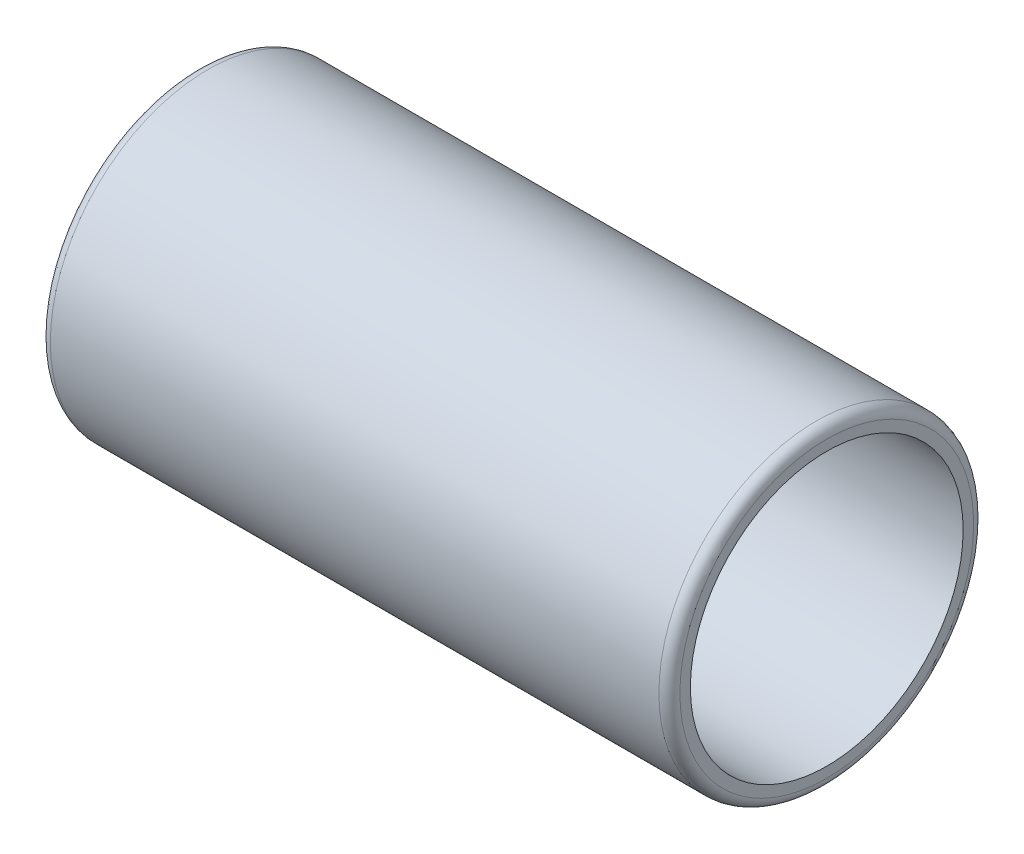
ISO-10303-21;
HEADER;
FILE_DESCRIPTION(('STEP AP214'),'2;1');
FILE_NAME('part.step','',(''),(''),'','','');
FILE_SCHEMA(('AUTOMOTIVE_DESIGN { 1 0 10303 214 1 1 1 1 }'));
ENDSEC;
DATA;
#1=APPLICATION_CONTEXT('core data for automotive mechanical design processes');
#2=APPLICATION_PROTOCOL_DEFINITION('international standard','automotive_design',2000,#1);
#3=PRODUCT_CONTEXT('',#1,'mechanical');
#4=PRODUCT('Part','Part','',(#3));
#5=PRODUCT_RELATED_PRODUCT_CATEGORY('part','',(#4));
#6=PRODUCT_DEFINITION_FORMATION('','',#4);
#7=PRODUCT_DEFINITION_CONTEXT('part definition',#1,'design');
#8=PRODUCT_DEFINITION('design','',#6,#7);
#9=PRODUCT_DEFINITION_SHAPE('','',#8);
#10=(LENGTH_UNIT() NAMED_UNIT(*) SI_UNIT(.MILLI.,.METRE.));
#11=(NAMED_UNIT(*) PLANE_ANGLE_UNIT() SI_UNIT($,.RADIAN.));
#12=(NAMED_UNIT(*) SI_UNIT($,.STERADIAN.) SOLID_ANGLE_UNIT());
#13=UNCERTAINTY_MEASURE_WITH_UNIT(LENGTH_MEASURE(1.E-05),#10,'distance_accuracy_value','');
#14=(GEOMETRIC_REPRESENTATION_CONTEXT(3) GLOBAL_UNCERTAINTY_ASSIGNED_CONTEXT((#13)) GLOBAL_UNIT_ASSIGNED_CONTEXT((#10,
#11,#12)) REPRESENTATION_CONTEXT('',''));
#15=CARTESIAN_POINT('',(0.,0.,0.));
#16=DIRECTION('',(0.,0.,1.));
#17=DIRECTION('',(1.,0.,0.));
#18=AXIS2_PLACEMENT_3D('',#15,#16,#17);
#19=CARTESIAN_POINT('',(0.,0.,0.));
#20=DIRECTION('',(-1.,0.,0.));
#21=DIRECTION('',(0.,0.,1.));
#22=AXIS2_PLACEMENT_3D('',#19,#20,#21);
#23=CYLINDRICAL_SURFACE('',#22,6.);
#24=CARTESIAN_POINT('',(5.99999999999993,0.,0.));
#25=DIRECTION('',(-1.,0.,0.));
#26=DIRECTION('',(0.,0.,1.));
#27=AXIS2_PLACEMENT_3D('',#24,#25,#26);
#28=CIRCLE('',#27,6.);
#29=CARTESIAN_POINT('',(5.99999999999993,0.,6.));
#30=VERTEX_POINT('',#29);
#31=EDGE_CURVE('E43',#30,#30,#28,.T.);
#32=ORIENTED_EDGE('',*,*,#31,.F.);
#33=EDGE_LOOP('',(#32));
#34=FACE_BOUND('',#33,.T.);
#35=CARTESIAN_POINT('',(0.,0.,0.));
#36=DIRECTION('',(-1.,0.,0.));
#37=DIRECTION('',(0.,0.,1.));
#38=AXIS2_PLACEMENT_3D('',#35,#36,#37);
#39=CIRCLE('',#38,6.);
#40=CARTESIAN_POINT('',(0.,0.,6.));
#41=VERTEX_POINT('',#40);
#42=EDGE_CURVE('E34',#41,#41,#39,.T.);
#43=ORIENTED_EDGE('',*,*,#42,.T.);
#44=EDGE_LOOP('',(#43));
#45=FACE_BOUND('',#44,.T.);
#46=ADVANCED_FACE('F14',(#34,#45),#23,.F.);
#47=CARTESIAN_POINT('',(0.,6.,0.));
#48=DIRECTION('',(1.,0.,0.));
#49=DIRECTION('',(0.,0.,-1.));
#50=AXIS2_PLACEMENT_3D('',#47,#48,#49);
#51=PLANE('',#50);
#52=CARTESIAN_POINT('',(0.,0.,0.));
#53=DIRECTION('',(1.,0.,0.));
#54=DIRECTION('',(0.,0.,-1.));
#55=AXIS2_PLACEMENT_3D('',#52,#53,#54);
#56=CIRCLE('',#55,14.);
#57=CARTESIAN_POINT('',(0.,0.,-14.));
#58=VERTEX_POINT('',#57);
#59=EDGE_CURVE('E21',#58,#58,#56,.F.);
#60=ORIENTED_EDGE('',*,*,#59,.T.);
#61=EDGE_LOOP('',(#60));
#62=FACE_BOUND('',#61,.T.);
#63=ORIENTED_EDGE('',*,*,#42,.F.);
#64=EDGE_LOOP('',(#63));
#65=FACE_BOUND('',#64,.T.);
#66=ADVANCED_FACE('F51',(#62,#65),#51,.F.);
#67=CARTESIAN_POINT('',(0.,0.,0.));
#68=DIRECTION('',(-1.,0.,0.));
#69=DIRECTION('',(0.,0.,1.));
#70=AXIS2_PLACEMENT_3D('',#67,#68,#69);
#71=CYLINDRICAL_SURFACE('',#70,15.);
#72=CARTESIAN_POINT('',(1.,0.,0.));
#73=DIRECTION('',(1.,0.,0.));
#74=DIRECTION('',(0.,0.,-1.));
#75=AXIS2_PLACEMENT_3D('',#72,#73,#74);
#76=CIRCLE('',#75,15.);
#77=CARTESIAN_POINT('',(1.,0.,-15.));
#78=VERTEX_POINT('',#77);
#79=EDGE_CURVE('E9',#78,#78,#76,.T.);
#80=ORIENTED_EDGE('',*,*,#79,.T.);
#81=EDGE_LOOP('',(#80));
#82=FACE_BOUND('',#81,.T.);
#83=CARTESIAN_POINT('',(59.,0.,0.));
#84=DIRECTION('',(-1.,0.,0.));
#85=DIRECTION('',(0.,0.,1.));
#86=AXIS2_PLACEMENT_3D('',#83,#84,#85);
#87=CIRCLE('',#86,15.);
#88=CARTESIAN_POINT('',(59.,0.,15.));
#89=VERTEX_POINT('',#88);
#90=EDGE_CURVE('E29',#89,#89,#87,.T.);
#91=ORIENTED_EDGE('',*,*,#90,.T.);
#92=EDGE_LOOP('',(#91));
#93=FACE_BOUND('',#92,.T.);
#94=ADVANCED_FACE('F56',(#82,#93),#71,.T.);
#95=CARTESIAN_POINT('',(60.,15.,0.));
#96=DIRECTION('',(-1.,0.,0.));
#97=DIRECTION('',(0.,0.,1.));
#98=AXIS2_PLACEMENT_3D('',#95,#96,#97);
#99=PLANE('',#98);
#100=CARTESIAN_POINT('',(60.,0.,0.));
#101=DIRECTION('',(-1.,0.,0.));
#102=DIRECTION('',(0.,0.,1.));
#103=AXIS2_PLACEMENT_3D('',#100,#101,#102);
#104=CIRCLE('',#103,14.);
#105=CARTESIAN_POINT('',(60.,0.,14.));
#106=VERTEX_POINT('',#105);
#107=EDGE_CURVE('E25',#106,#106,#104,.F.);
#108=ORIENTED_EDGE('',*,*,#107,.T.);
#109=EDGE_LOOP('',(#108));
#110=FACE_BOUND('',#109,.T.);
#111=CARTESIAN_POINT('',(60.,0.,0.));
#112=DIRECTION('',(-1.,0.,0.));
#113=DIRECTION('',(0.,0.,1.));
#114=AXIS2_PLACEMENT_3D('',#111,#112,#113);
#115=CIRCLE('',#114,13.);
#116=CARTESIAN_POINT('',(60.,0.,13.));
#117=VERTEX_POINT('',#116);
#118=EDGE_CURVE('E37',#117,#117,#115,.T.);
#119=ORIENTED_EDGE('',*,*,#118,.T.);
#120=EDGE_LOOP('',(#119));
#121=FACE_BOUND('',#120,.T.);
#122=ADVANCED_FACE('F63',(#110,#121),#99,.F.);
#123=CARTESIAN_POINT('',(0.,0.,0.));
#124=DIRECTION('',(-1.,0.,0.));
#125=DIRECTION('',(0.,0.,1.));
#126=AXIS2_PLACEMENT_3D('',#123,#124,#125);
#127=CYLINDRICAL_SURFACE('',#126,13.);
#128=ORIENTED_EDGE('',*,*,#118,.F.);
#129=EDGE_LOOP('',(#128));
#130=FACE_BOUND('',#129,.T.);
#131=CARTESIAN_POINT('',(13.,0.,0.));
#132=DIRECTION('',(-1.,0.,0.));
#133=DIRECTION('',(0.,0.,1.));
#134=AXIS2_PLACEMENT_3D('',#131,#132,#133);
#135=CIRCLE('',#134,13.);
#136=CARTESIAN_POINT('',(13.,0.,13.));
#137=VERTEX_POINT('',#136);
#138=EDGE_CURVE('E40',#137,#137,#135,.T.);
#139=ORIENTED_EDGE('',*,*,#138,.T.);
#140=EDGE_LOOP('',(#139));
#141=FACE_BOUND('',#140,.T.);
#142=ADVANCED_FACE('F75',(#130,#141),#127,.F.);
#143=CARTESIAN_POINT('',(5.99999999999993,0.,0.));
#144=DIRECTION('',(1.,0.,0.));
#145=DIRECTION('',(0.,0.,-1.));
#146=AXIS2_PLACEMENT_3D('',#143,#144,#145);
#147=CONICAL_SURFACE('',#146,6.,0.785398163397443);
#148=ORIENTED_EDGE('',*,*,#138,.F.);
#149=EDGE_LOOP('',(#148));
#150=FACE_BOUND('',#149,.T.);
#151=ORIENTED_EDGE('',*,*,#31,.T.);
#152=EDGE_LOOP('',(#151));
#153=FACE_BOUND('',#152,.T.);
#154=ADVANCED_FACE('F47',(#150,#153),#147,.F.);
#155=CARTESIAN_POINT('',(59.,0.,0.));
#156=DIRECTION('',(-1.,0.,0.));
#157=DIRECTION('',(0.,0.,1.));
#158=AXIS2_PLACEMENT_3D('',#155,#156,#157);
#159=TOROIDAL_SURFACE('',#158,14.,1.);
#160=ORIENTED_EDGE('',*,*,#107,.F.);
#161=EDGE_LOOP('',(#160));
#162=FACE_BOUND('',#161,.T.);
#163=ORIENTED_EDGE('',*,*,#90,.F.);
#164=EDGE_LOOP('',(#163));
#165=FACE_BOUND('',#164,.T.);
#166=ADVANCED_FACE('F66',(#162,#165),#159,.T.);
#167=CARTESIAN_POINT('',(1.,0.,0.));
#168=DIRECTION('',(1.,0.,0.));
#169=DIRECTION('',(0.,0.,-1.));
#170=AXIS2_PLACEMENT_3D('',#167,#168,#169);
#171=TOROIDAL_SURFACE('',#170,14.,1.);
#172=ORIENTED_EDGE('',*,*,#79,.F.);
#173=EDGE_LOOP('',(#172));
#174=FACE_BOUND('',#173,.T.);
#175=ORIENTED_EDGE('',*,*,#59,.F.);
#176=EDGE_LOOP('',(#175));
#177=FACE_BOUND('',#176,.T.);
#178=ADVANCED_FACE('F16',(#174,#177),#171,.T.);
#179=CLOSED_SHELL('',(#46,#66,#94,#122,#142,#154,#166,#178));
#180=MANIFOLD_SOLID_BREP('B1',#179);
#181=ADVANCED_BREP_SHAPE_REPRESENTATION('',(#18,#180),#14);
#182=SHAPE_DEFINITION_REPRESENTATION(#9,#181);
ENDSEC;
END-ISO-10303-21;
